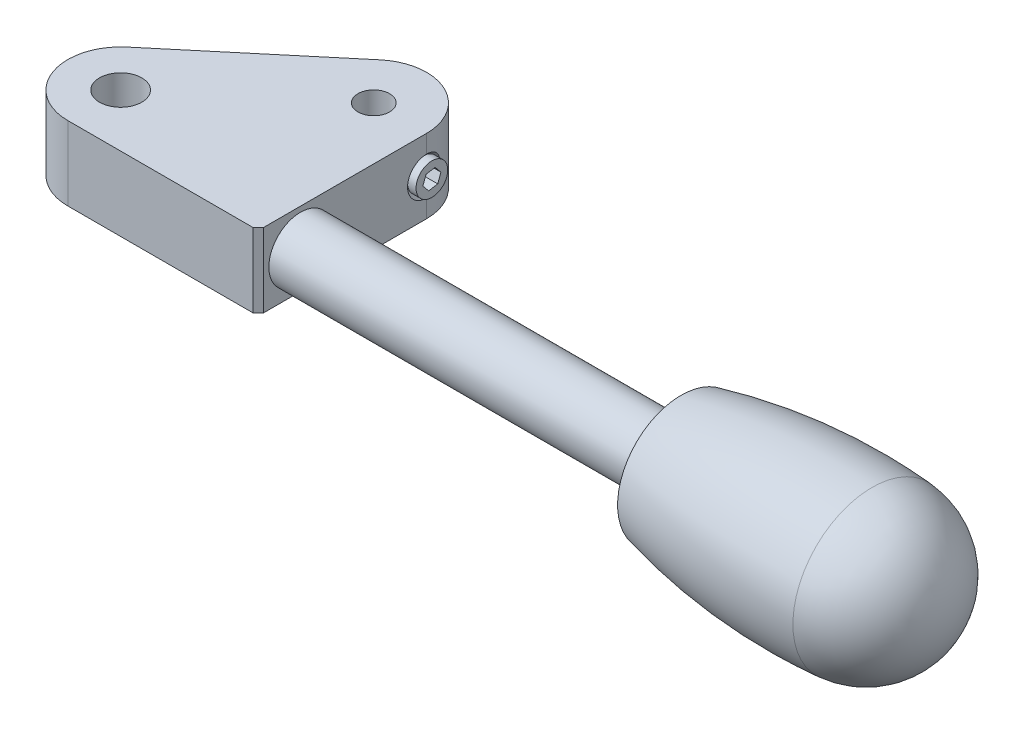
ISO-10303-21;
HEADER;
FILE_DESCRIPTION(('STEP AP214'),'2;1');
FILE_NAME('part.step','',(''),(''),'','','');
FILE_SCHEMA(('AUTOMOTIVE_DESIGN { 1 0 10303 214 1 1 1 1 }'));
ENDSEC;
DATA;
#1=APPLICATION_CONTEXT('core data for automotive mechanical design processes');
#2=APPLICATION_PROTOCOL_DEFINITION('international standard','automotive_design',2000,#1);
#3=PRODUCT_CONTEXT('',#1,'mechanical');
#4=PRODUCT('Part','Part','',(#3));
#5=PRODUCT_RELATED_PRODUCT_CATEGORY('part','',(#4));
#6=PRODUCT_DEFINITION_FORMATION('','',#4);
#7=PRODUCT_DEFINITION_CONTEXT('part definition',#1,'design');
#8=PRODUCT_DEFINITION('design','',#6,#7);
#9=PRODUCT_DEFINITION_SHAPE('','',#8);
#10=(LENGTH_UNIT() NAMED_UNIT(*) SI_UNIT(.MILLI.,.METRE.));
#11=(NAMED_UNIT(*) PLANE_ANGLE_UNIT() SI_UNIT($,.RADIAN.));
#12=(NAMED_UNIT(*) SI_UNIT($,.STERADIAN.) SOLID_ANGLE_UNIT());
#13=UNCERTAINTY_MEASURE_WITH_UNIT(LENGTH_MEASURE(1.E-05),#10,'distance_accuracy_value','');
#14=(GEOMETRIC_REPRESENTATION_CONTEXT(3) GLOBAL_UNCERTAINTY_ASSIGNED_CONTEXT((#13)) GLOBAL_UNIT_ASSIGNED_CONTEXT((#10,
#11,#12)) REPRESENTATION_CONTEXT('',''));
#15=CARTESIAN_POINT('',(0.,0.,0.));
#16=DIRECTION('',(0.,0.,1.));
#17=DIRECTION('',(1.,0.,0.));
#18=AXIS2_PLACEMENT_3D('',#15,#16,#17);
#19=CARTESIAN_POINT('',(70.0227555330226,0.,0.999999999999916));
#20=DIRECTION('',(-1.,0.,0.));
#21=DIRECTION('',(0.,-1.,0.));
#22=AXIS2_PLACEMENT_3D('',#19,#20,#21);
#23=CYLINDRICAL_SURFACE('',#22,3.);
#24=CARTESIAN_POINT('',(54.0227555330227,0.,0.999999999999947));
#25=DIRECTION('',(-1.,0.,0.));
#26=DIRECTION('',(0.,0.,-1.));
#27=AXIS2_PLACEMENT_3D('',#24,#25,#26);
#28=CIRCLE('',#27,3.);
#29=CARTESIAN_POINT('',(54.0227555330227,0.,-2.00000000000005));
#30=VERTEX_POINT('',#29);
#31=EDGE_CURVE('E18',#30,#30,#28,.T.);
#32=ORIENTED_EDGE('',*,*,#31,.T.);
#33=EDGE_LOOP('',(#32));
#34=FACE_BOUND('',#33,.T.);
#35=CARTESIAN_POINT('',(18.0227555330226,0.,1.));
#36=DIRECTION('',(-1.,0.,0.));
#37=DIRECTION('',(0.,0.,-1.));
#38=AXIS2_PLACEMENT_3D('',#35,#36,#37);
#39=CIRCLE('',#38,3.);
#40=CARTESIAN_POINT('',(18.0227555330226,0.,-2.));
#41=VERTEX_POINT('',#40);
#42=EDGE_CURVE('E9',#41,#41,#39,.F.);
#43=ORIENTED_EDGE('',*,*,#42,.T.);
#44=EDGE_LOOP('',(#43));
#45=FACE_BOUND('',#44,.T.);
#46=ADVANCED_FACE('F14',(#34,#45),#23,.T.);
#47=CARTESIAN_POINT('',(16.5227555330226,-0.145018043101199,-10.0735921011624));
#48=DIRECTION('',(1.,0.,0.));
#49=DIRECTION('',(0.,0.98588015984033,0.167452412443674));
#50=AXIS2_PLACEMENT_3D('',#47,#48,#49);
#51=PLANE('',#50);
#52=DIRECTION('',(0.,-0.937523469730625,0.347922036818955));
#53=VECTOR('',#52,1.);
#54=CARTESIAN_POINT('',(16.5227555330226,0.666901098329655,-10.374901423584));
#55=LINE('',#54,#53);
#56=CARTESIAN_POINT('',(16.5227555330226,0.666901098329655,-10.374901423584));
#57=VERTEX_POINT('',#56);
#58=CARTESIAN_POINT('',(16.5227555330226,-0.145018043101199,-10.0735921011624));
#59=VERTEX_POINT('',#58);
#60=EDGE_CURVE('E163',#57,#59,#55,.T.);
#61=ORIENTED_EDGE('',*,*,#60,.T.);
#62=DIRECTION('',(0.,-0.770071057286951,-0.637958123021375));
#63=VECTOR('',#62,1.);
#64=CARTESIAN_POINT('',(16.5227555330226,-0.145018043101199,-10.0735921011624));
#65=LINE('',#64,#63);
#66=CARTESIAN_POINT('',(16.5227555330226,-0.811919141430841,-10.6260800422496));
#67=VERTEX_POINT('',#66);
#68=EDGE_CURVE('E514',#59,#67,#65,.T.);
#69=ORIENTED_EDGE('',*,*,#68,.T.);
#70=DIRECTION('',(0.,0.167452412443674,-0.98588015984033));
#71=VECTOR('',#70,1.);
#72=CARTESIAN_POINT('',(16.5227555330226,-0.811919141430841,-10.6260800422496));
#73=LINE('',#72,#71);
#74=CARTESIAN_POINT('',(16.5227555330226,-0.666901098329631,-11.4798773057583));
#75=VERTEX_POINT('',#74);
#76=EDGE_CURVE('E515',#67,#75,#73,.T.);
#77=ORIENTED_EDGE('',*,*,#76,.T.);
#78=DIRECTION('',(0.,0.937523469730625,-0.347922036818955));
#79=VECTOR('',#78,1.);
#80=CARTESIAN_POINT('',(16.5227555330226,-0.666901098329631,-11.4798773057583));
#81=LINE('',#80,#79);
#82=CARTESIAN_POINT('',(16.5227555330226,0.145018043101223,-11.78118662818));
#83=VERTEX_POINT('',#82);
#84=EDGE_CURVE('E144',#75,#83,#81,.T.);
#85=ORIENTED_EDGE('',*,*,#84,.T.);
#86=DIRECTION('',(0.,0.770071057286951,0.637958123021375));
#87=VECTOR('',#86,1.);
#88=CARTESIAN_POINT('',(16.5227555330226,0.145018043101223,-11.78118662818));
#89=LINE('',#88,#87);
#90=CARTESIAN_POINT('',(16.5227555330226,0.811919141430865,-11.2286986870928));
#91=VERTEX_POINT('',#90);
#92=EDGE_CURVE('E130',#83,#91,#89,.T.);
#93=ORIENTED_EDGE('',*,*,#92,.T.);
#94=DIRECTION('',(0.,-0.167452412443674,0.98588015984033));
#95=VECTOR('',#94,1.);
#96=CARTESIAN_POINT('',(16.5227555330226,0.811919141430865,-11.2286986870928));
#97=LINE('',#96,#95);
#98=EDGE_CURVE('E141',#91,#57,#97,.T.);
#99=ORIENTED_EDGE('',*,*,#98,.T.);
#100=EDGE_LOOP('',(#61,#69,#77,#85,#93,#99));
#101=FACE_BOUND('',#100,.T.);
#102=ADVANCED_FACE('F140',(#101),#51,.T.);
#103=CARTESIAN_POINT('',(16.5227555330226,-0.145018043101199,-10.0735921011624));
#104=DIRECTION('',(0.,-0.637958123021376,0.770071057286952));
#105=DIRECTION('',(0.,-0.770071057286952,-0.637958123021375));
#106=AXIS2_PLACEMENT_3D('',#103,#104,#105);
#107=PLANE('',#106);
#108=DIRECTION('',(0.,-0.770071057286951,-0.637958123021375));
#109=VECTOR('',#108,1.);
#110=CARTESIAN_POINT('',(18.5227555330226,-0.145018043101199,-10.0735921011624));
#111=LINE('',#110,#109);
#112=CARTESIAN_POINT('',(18.5227555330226,-0.145018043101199,-10.0735921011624));
#113=VERTEX_POINT('',#112);
#114=CARTESIAN_POINT('',(18.5227555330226,-0.811919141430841,-10.6260800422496));
#115=VERTEX_POINT('',#114);
#116=EDGE_CURVE('E152',#113,#115,#111,.T.);
#117=ORIENTED_EDGE('',*,*,#116,.T.);
#118=DIRECTION('',(1.,0.,0.));
#119=VECTOR('',#118,1.);
#120=CARTESIAN_POINT('',(16.5227555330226,-0.811919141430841,-10.6260800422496));
#121=LINE('',#120,#119);
#122=EDGE_CURVE('E96',#67,#115,#121,.T.);
#123=ORIENTED_EDGE('',*,*,#122,.F.);
#124=ORIENTED_EDGE('',*,*,#68,.F.);
#125=DIRECTION('',(1.,0.,0.));
#126=VECTOR('',#125,1.);
#127=CARTESIAN_POINT('',(16.5227555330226,-0.145018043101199,-10.0735921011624));
#128=LINE('',#127,#126);
#129=EDGE_CURVE('E117',#59,#113,#128,.T.);
#130=ORIENTED_EDGE('',*,*,#129,.T.);
#131=EDGE_LOOP('',(#117,#123,#124,#130));
#132=FACE_BOUND('',#131,.T.);
#133=ADVANCED_FACE('F336',(#132),#107,.F.);
#134=CARTESIAN_POINT('',(16.5227555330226,-0.811919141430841,-10.6260800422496));
#135=DIRECTION('',(0.,-0.98588015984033,-0.167452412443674));
#136=DIRECTION('',(0.,0.167452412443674,-0.98588015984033));
#137=AXIS2_PLACEMENT_3D('',#134,#135,#136);
#138=PLANE('',#137);
#139=DIRECTION('',(0.,0.167452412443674,-0.98588015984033));
#140=VECTOR('',#139,1.);
#141=CARTESIAN_POINT('',(18.5227555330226,-0.811919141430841,-10.6260800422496));
#142=LINE('',#141,#140);
#143=CARTESIAN_POINT('',(18.5227555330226,-0.66690109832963,-11.4798773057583));
#144=VERTEX_POINT('',#143);
#145=EDGE_CURVE('E155',#115,#144,#142,.T.);
#146=ORIENTED_EDGE('',*,*,#145,.T.);
#147=DIRECTION('',(1.,0.,0.));
#148=VECTOR('',#147,1.);
#149=CARTESIAN_POINT('',(16.5227555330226,-0.666901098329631,-11.4798773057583));
#150=LINE('',#149,#148);
#151=EDGE_CURVE('E167',#75,#144,#150,.T.);
#152=ORIENTED_EDGE('',*,*,#151,.F.);
#153=ORIENTED_EDGE('',*,*,#76,.F.);
#154=ORIENTED_EDGE('',*,*,#122,.T.);
#155=EDGE_LOOP('',(#146,#152,#153,#154));
#156=FACE_BOUND('',#155,.T.);
#157=ADVANCED_FACE('F339',(#156),#138,.F.);
#158=CARTESIAN_POINT('',(16.5227555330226,-0.666901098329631,-11.4798773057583));
#159=DIRECTION('',(0.,-0.347922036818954,-0.937523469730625));
#160=DIRECTION('',(0.,0.937523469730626,-0.347922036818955));
#161=AXIS2_PLACEMENT_3D('',#158,#159,#160);
#162=PLANE('',#161);
#163=DIRECTION('',(0.,0.937523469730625,-0.347922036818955));
#164=VECTOR('',#163,1.);
#165=CARTESIAN_POINT('',(18.5227555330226,-0.66690109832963,-11.4798773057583));
#166=LINE('',#165,#164);
#167=CARTESIAN_POINT('',(18.5227555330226,0.145018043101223,-11.78118662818));
#168=VERTEX_POINT('',#167);
#169=EDGE_CURVE('E157',#144,#168,#166,.T.);
#170=ORIENTED_EDGE('',*,*,#169,.T.);
#171=DIRECTION('',(1.,0.,0.));
#172=VECTOR('',#171,1.);
#173=CARTESIAN_POINT('',(16.5227555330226,0.145018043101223,-11.78118662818));
#174=LINE('',#173,#172);
#175=EDGE_CURVE('E135',#83,#168,#174,.T.);
#176=ORIENTED_EDGE('',*,*,#175,.F.);
#177=ORIENTED_EDGE('',*,*,#84,.F.);
#178=ORIENTED_EDGE('',*,*,#151,.T.);
#179=EDGE_LOOP('',(#170,#176,#177,#178));
#180=FACE_BOUND('',#179,.T.);
#181=ADVANCED_FACE('F343',(#180),#162,.F.);
#182=CARTESIAN_POINT('',(16.5227555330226,0.145018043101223,-11.78118662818));
#183=DIRECTION('',(0.,0.637958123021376,-0.770071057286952));
#184=DIRECTION('',(0.,0.770071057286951,0.637958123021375));
#185=AXIS2_PLACEMENT_3D('',#182,#183,#184);
#186=PLANE('',#185);
#187=DIRECTION('',(0.,0.770071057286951,0.637958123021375));
#188=VECTOR('',#187,1.);
#189=CARTESIAN_POINT('',(18.5227555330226,0.145018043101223,-11.78118662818));
#190=LINE('',#189,#188);
#191=CARTESIAN_POINT('',(18.5227555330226,0.811919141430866,-11.2286986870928));
#192=VERTEX_POINT('',#191);
#193=EDGE_CURVE('E133',#168,#192,#190,.T.);
#194=ORIENTED_EDGE('',*,*,#193,.T.);
#195=DIRECTION('',(1.,0.,0.));
#196=VECTOR('',#195,1.);
#197=CARTESIAN_POINT('',(16.5227555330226,0.811919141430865,-11.2286986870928));
#198=LINE('',#197,#196);
#199=EDGE_CURVE('E110',#91,#192,#198,.T.);
#200=ORIENTED_EDGE('',*,*,#199,.F.);
#201=ORIENTED_EDGE('',*,*,#92,.F.);
#202=ORIENTED_EDGE('',*,*,#175,.T.);
#203=EDGE_LOOP('',(#194,#200,#201,#202));
#204=FACE_BOUND('',#203,.T.);
#205=ADVANCED_FACE('F129',(#204),#186,.F.);
#206=CARTESIAN_POINT('',(16.5227555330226,0.811919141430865,-11.2286986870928));
#207=DIRECTION('',(0.,0.98588015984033,0.167452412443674));
#208=DIRECTION('',(0.,-0.167452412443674,0.98588015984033));
#209=AXIS2_PLACEMENT_3D('',#206,#207,#208);
#210=PLANE('',#209);
#211=DIRECTION('',(0.,-0.167452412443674,0.98588015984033));
#212=VECTOR('',#211,1.);
#213=CARTESIAN_POINT('',(18.5227555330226,0.811919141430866,-11.2286986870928));
#214=LINE('',#213,#212);
#215=CARTESIAN_POINT('',(18.5227555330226,0.666901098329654,-10.374901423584));
#216=VERTEX_POINT('',#215);
#217=EDGE_CURVE('E161',#192,#216,#214,.T.);
#218=ORIENTED_EDGE('',*,*,#217,.T.);
#219=DIRECTION('',(1.,0.,0.));
#220=VECTOR('',#219,1.);
#221=CARTESIAN_POINT('',(16.5227555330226,0.666901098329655,-10.374901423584));
#222=LINE('',#221,#220);
#223=EDGE_CURVE('E114',#57,#216,#222,.T.);
#224=ORIENTED_EDGE('',*,*,#223,.F.);
#225=ORIENTED_EDGE('',*,*,#98,.F.);
#226=ORIENTED_EDGE('',*,*,#199,.T.);
#227=EDGE_LOOP('',(#218,#224,#225,#226));
#228=FACE_BOUND('',#227,.T.);
#229=ADVANCED_FACE('F146',(#228),#210,.F.);
#230=CARTESIAN_POINT('',(16.5227555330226,0.666901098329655,-10.374901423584));
#231=DIRECTION('',(0.,0.347922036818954,0.937523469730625));
#232=DIRECTION('',(0.,-0.937523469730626,0.347922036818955));
#233=AXIS2_PLACEMENT_3D('',#230,#231,#232);
#234=PLANE('',#233);
#235=DIRECTION('',(0.,-0.937523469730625,0.347922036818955));
#236=VECTOR('',#235,1.);
#237=CARTESIAN_POINT('',(18.5227555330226,0.666901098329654,-10.374901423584));
#238=LINE('',#237,#236);
#239=EDGE_CURVE('E33',#216,#113,#238,.T.);
#240=ORIENTED_EDGE('',*,*,#239,.T.);
#241=ORIENTED_EDGE('',*,*,#129,.F.);
#242=ORIENTED_EDGE('',*,*,#60,.F.);
#243=ORIENTED_EDGE('',*,*,#223,.T.);
#244=EDGE_LOOP('',(#240,#241,#242,#243));
#245=FACE_BOUND('',#244,.T.);
#246=ADVANCED_FACE('F330',(#245),#234,.F.);
#247=CARTESIAN_POINT('',(18.5227555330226,-0.251178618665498,-9.44856912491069));
#248=DIRECTION('',(1.,0.,0.));
#249=DIRECTION('',(0.,0.167452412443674,-0.98588015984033));
#250=AXIS2_PLACEMENT_3D('',#247,#248,#249);
#251=PLANE('',#250);
#252=ORIENTED_EDGE('',*,*,#239,.F.);
#253=ORIENTED_EDGE('',*,*,#217,.F.);
#254=ORIENTED_EDGE('',*,*,#193,.F.);
#255=ORIENTED_EDGE('',*,*,#169,.F.);
#256=ORIENTED_EDGE('',*,*,#145,.F.);
#257=ORIENTED_EDGE('',*,*,#116,.F.);
#258=EDGE_LOOP('',(#252,#253,#254,#255,#256,#257));
#259=FACE_BOUND('',#258,.T.);
#260=CARTESIAN_POINT('',(18.5227555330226,0.,-10.9273893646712));
#261=DIRECTION('',(-1.,0.,0.));
#262=DIRECTION('',(0.,-0.167452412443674,0.98588015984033));
#263=AXIS2_PLACEMENT_3D('',#260,#261,#262);
#264=CIRCLE('',#263,1.5);
#265=CARTESIAN_POINT('',(18.5227555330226,-0.251178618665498,-9.4485691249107));
#266=VERTEX_POINT('',#265);
#267=EDGE_CURVE('E164',#266,#266,#264,.T.);
#268=ORIENTED_EDGE('',*,*,#267,.F.);
#269=EDGE_LOOP('',(#268));
#270=FACE_BOUND('',#269,.T.);
#271=ADVANCED_FACE('F324',(#259,#270),#251,.T.);
#272=CARTESIAN_POINT('',(14.5227555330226,0.,-10.9273893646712));
#273=DIRECTION('',(-1.,0.,0.));
#274=DIRECTION('',(0.,-0.167452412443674,0.98588015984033));
#275=AXIS2_PLACEMENT_3D('',#272,#273,#274);
#276=CYLINDRICAL_SURFACE('',#275,1.5);
#277=ORIENTED_EDGE('',*,*,#267,.T.);
#278=EDGE_LOOP('',(#277));
#279=FACE_BOUND('',#278,.T.);
#280=CARTESIAN_POINT('',(17.7227555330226,0.,-10.9273893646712));
#281=DIRECTION('',(1.,0.,0.));
#282=DIRECTION('',(0.,0.,1.));
#283=AXIS2_PLACEMENT_3D('',#280,#281,#282);
#284=CIRCLE('',#283,1.5);
#285=CARTESIAN_POINT('',(17.7227555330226,0.,-9.4273893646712));
#286=VERTEX_POINT('',#285);
#287=EDGE_CURVE('E24',#286,#286,#284,.T.);
#288=ORIENTED_EDGE('',*,*,#287,.T.);
#289=EDGE_LOOP('',(#288));
#290=FACE_BOUND('',#289,.T.);
#291=ADVANCED_FACE('F261',(#279,#290),#276,.T.);
#292=CARTESIAN_POINT('',(0.,3.5,0.));
#293=DIRECTION('',(0.,-1.,0.));
#294=DIRECTION('',(0.766044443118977,0.,-0.642787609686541));
#295=AXIS2_PLACEMENT_3D('',#292,#293,#294);
#296=CYLINDRICAL_SURFACE('',#295,5.);
#297=CARTESIAN_POINT('',(0.,-3.5,0.));
#298=DIRECTION('',(0.,1.,0.));
#299=DIRECTION('',(-0.766044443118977,0.,0.642787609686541));
#300=AXIS2_PLACEMENT_3D('',#297,#298,#299);
#301=CIRCLE('',#300,5.);
#302=CARTESIAN_POINT('',(-3.21393804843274,-3.5,-3.83022221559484));
#303=VERTEX_POINT('',#302);
#304=CARTESIAN_POINT('',(0.,-3.5,5.));
#305=VERTEX_POINT('',#304);
#306=EDGE_CURVE('E187',#303,#305,#301,.T.);
#307=ORIENTED_EDGE('',*,*,#306,.T.);
#308=DIRECTION('',(0.,-1.,0.));
#309=VECTOR('',#308,1.);
#310=CARTESIAN_POINT('',(0.,3.5,5.));
#311=LINE('',#310,#309);
#312=CARTESIAN_POINT('',(0.,3.5,5.));
#313=VERTEX_POINT('',#312);
#314=EDGE_CURVE('E221',#313,#305,#311,.T.);
#315=ORIENTED_EDGE('',*,*,#314,.F.);
#316=CARTESIAN_POINT('',(0.,3.5,0.));
#317=DIRECTION('',(0.,1.,0.));
#318=DIRECTION('',(-0.766044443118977,0.,0.642787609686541));
#319=AXIS2_PLACEMENT_3D('',#316,#317,#318);
#320=CIRCLE('',#319,5.);
#321=CARTESIAN_POINT('',(-3.21393804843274,3.5,-3.83022221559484));
#322=VERTEX_POINT('',#321);
#323=EDGE_CURVE('E190',#322,#313,#320,.T.);
#324=ORIENTED_EDGE('',*,*,#323,.F.);
#325=DIRECTION('',(0.,-1.,0.));
#326=VECTOR('',#325,1.);
#327=CARTESIAN_POINT('',(-3.21393804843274,3.5,-3.83022221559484));
#328=LINE('',#327,#326);
#329=EDGE_CURVE('E202',#322,#303,#328,.T.);
#330=ORIENTED_EDGE('',*,*,#329,.T.);
#331=EDGE_LOOP('',(#307,#315,#324,#330));
#332=FACE_BOUND('',#331,.T.);
#333=ADVANCED_FACE('F258',(#332),#296,.T.);
#334=CARTESIAN_POINT('',(9.80881748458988,3.5,-14.757611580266));
#335=DIRECTION('',(0.642787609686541,0.,0.766044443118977));
#336=DIRECTION('',(0.,1.,0.));
#337=AXIS2_PLACEMENT_3D('',#334,#335,#336);
#338=PLANE('',#337);
#339=DIRECTION('',(-0.766044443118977,0.,0.642787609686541));
#340=VECTOR('',#339,1.);
#341=CARTESIAN_POINT('',(9.80881748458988,-3.5,-14.757611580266));
#342=LINE('',#341,#340);
#343=CARTESIAN_POINT('',(9.80881748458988,-3.5,-14.757611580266));
#344=VERTEX_POINT('',#343);
#345=EDGE_CURVE('E194',#344,#303,#342,.T.);
#346=ORIENTED_EDGE('',*,*,#345,.T.);
#347=ORIENTED_EDGE('',*,*,#329,.F.);
#348=DIRECTION('',(-0.766044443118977,0.,0.642787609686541));
#349=VECTOR('',#348,1.);
#350=CARTESIAN_POINT('',(9.80881748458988,3.5,-14.757611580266));
#351=LINE('',#350,#349);
#352=CARTESIAN_POINT('',(9.80881748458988,3.5,-14.757611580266));
#353=VERTEX_POINT('',#352);
#354=EDGE_CURVE('E200',#353,#322,#351,.T.);
#355=ORIENTED_EDGE('',*,*,#354,.F.);
#356=DIRECTION('',(0.,-1.,0.));
#357=VECTOR('',#356,1.);
#358=CARTESIAN_POINT('',(9.80881748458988,3.5,-14.757611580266));
#359=LINE('',#358,#357);
#360=EDGE_CURVE('E214',#353,#344,#359,.T.);
#361=ORIENTED_EDGE('',*,*,#360,.T.);
#362=EDGE_LOOP('',(#346,#347,#355,#361));
#363=FACE_BOUND('',#362,.T.);
#364=ADVANCED_FACE('F246',(#363),#338,.F.);
#365=CARTESIAN_POINT('',(18.0227555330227,3.5,5.));
#366=DIRECTION('',(0.,0.,-1.));
#367=DIRECTION('',(-1.,0.,0.));
#368=AXIS2_PLACEMENT_3D('',#365,#366,#367);
#369=PLANE('',#368);
#370=DIRECTION('',(1.,0.,0.));
#371=VECTOR('',#370,1.);
#372=CARTESIAN_POINT('',(18.0227555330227,-3.5,5.));
#373=LINE('',#372,#371);
#374=CARTESIAN_POINT('',(17.5227555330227,-3.5,5.));
#375=VERTEX_POINT('',#374);
#376=EDGE_CURVE('E205',#305,#375,#373,.T.);
#377=ORIENTED_EDGE('',*,*,#376,.T.);
#378=DIRECTION('',(0.,1.,0.));
#379=VECTOR('',#378,1.);
#380=CARTESIAN_POINT('',(17.5227555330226,3.5,5.));
#381=LINE('',#380,#379);
#382=CARTESIAN_POINT('',(17.5227555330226,3.5,5.));
#383=VERTEX_POINT('',#382);
#384=EDGE_CURVE('E87',#375,#383,#381,.T.);
#385=ORIENTED_EDGE('',*,*,#384,.T.);
#386=DIRECTION('',(1.,0.,0.));
#387=VECTOR('',#386,1.);
#388=CARTESIAN_POINT('',(18.0227555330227,3.5,5.));
#389=LINE('',#388,#387);
#390=EDGE_CURVE('E193',#313,#383,#389,.T.);
#391=ORIENTED_EDGE('',*,*,#390,.F.);
#392=ORIENTED_EDGE('',*,*,#314,.T.);
#393=EDGE_LOOP('',(#377,#385,#391,#392));
#394=FACE_BOUND('',#393,.T.);
#395=ADVANCED_FACE('F254',(#394),#369,.F.);
#396=CARTESIAN_POINT('',(13.0227555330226,-3.5,-10.9273893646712));
#397=DIRECTION('',(0.,1.,0.));
#398=DIRECTION('',(-0.766044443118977,0.,0.642787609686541));
#399=AXIS2_PLACEMENT_3D('',#396,#397,#398);
#400=CYLINDRICAL_SURFACE('',#399,1.5);
#401=CARTESIAN_POINT('',(13.0227555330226,-3.5,-10.9273893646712));
#402=DIRECTION('',(0.,1.,0.));
#403=DIRECTION('',(-0.766044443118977,0.,0.642787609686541));
#404=AXIS2_PLACEMENT_3D('',#401,#402,#403);
#405=CIRCLE('',#404,1.5);
#406=CARTESIAN_POINT('',(11.8736888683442,-3.5,-9.96320795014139));
#407=VERTEX_POINT('',#406);
#408=EDGE_CURVE('E184',#407,#407,#405,.T.);
#409=ORIENTED_EDGE('',*,*,#408,.F.);
#410=EDGE_LOOP('',(#409));
#411=FACE_BOUND('',#410,.T.);
#412=CARTESIAN_POINT('',(13.0227555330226,3.5,-10.9273893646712));
#413=DIRECTION('',(0.,1.,0.));
#414=DIRECTION('',(-0.766044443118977,0.,0.642787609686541));
#415=AXIS2_PLACEMENT_3D('',#412,#413,#414);
#416=CIRCLE('',#415,1.5);
#417=CARTESIAN_POINT('',(11.8736888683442,3.5,-9.96320795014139));
#418=VERTEX_POINT('',#417);
#419=EDGE_CURVE('E181',#418,#418,#416,.T.);
#420=ORIENTED_EDGE('',*,*,#419,.T.);
#421=EDGE_LOOP('',(#420));
#422=FACE_BOUND('',#421,.T.);
#423=ADVANCED_FACE('F257',(#411,#422),#400,.F.);
#424=CARTESIAN_POINT('',(0.,-3.5,0.));
#425=DIRECTION('',(0.,1.,0.));
#426=DIRECTION('',(-0.766044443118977,0.,0.642787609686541));
#427=AXIS2_PLACEMENT_3D('',#424,#425,#426);
#428=CYLINDRICAL_SURFACE('',#427,2.);
#429=CARTESIAN_POINT('',(0.,-3.5,0.));
#430=DIRECTION('',(0.,1.,0.));
#431=DIRECTION('',(-0.766044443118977,0.,0.642787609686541));
#432=AXIS2_PLACEMENT_3D('',#429,#430,#431);
#433=CIRCLE('',#432,2.);
#434=CARTESIAN_POINT('',(-1.53208888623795,-3.5,1.28557521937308));
#435=VERTEX_POINT('',#434);
#436=EDGE_CURVE('E178',#435,#435,#433,.T.);
#437=ORIENTED_EDGE('',*,*,#436,.F.);
#438=EDGE_LOOP('',(#437));
#439=FACE_BOUND('',#438,.T.);
#440=CARTESIAN_POINT('',(0.,3.5,0.));
#441=DIRECTION('',(0.,1.,0.));
#442=DIRECTION('',(-0.766044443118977,0.,0.642787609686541));
#443=AXIS2_PLACEMENT_3D('',#440,#441,#442);
#444=CIRCLE('',#443,2.);
#445=CARTESIAN_POINT('',(-1.53208888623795,3.5,1.28557521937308));
#446=VERTEX_POINT('',#445);
#447=EDGE_CURVE('E176',#446,#446,#444,.T.);
#448=ORIENTED_EDGE('',*,*,#447,.T.);
#449=EDGE_LOOP('',(#448));
#450=FACE_BOUND('',#449,.T.);
#451=ADVANCED_FACE('F314',(#439,#450),#428,.F.);
#452=CARTESIAN_POINT('',(18.0227555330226,0.,-10.9273893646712));
#453=DIRECTION('',(1.,0.,0.));
#454=DIRECTION('',(0.,0.,-1.));
#455=AXIS2_PLACEMENT_3D('',#452,#453,#454);
#456=CONICAL_SURFACE('',#455,1.8,0.785398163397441);
#457=ORIENTED_EDGE('',*,*,#287,.F.);
#458=EDGE_LOOP('',(#457));
#459=FACE_BOUND('',#458,.T.);
#460=CARTESIAN_POINT('',(18.0227555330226,0.,-10.9273893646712));
#461=DIRECTION('',(1.,0.,0.));
#462=DIRECTION('',(0.,0.,-1.));
#463=AXIS2_PLACEMENT_3D('',#460,#461,#462);
#464=CIRCLE('',#463,1.8);
#465=CARTESIAN_POINT('',(18.0227555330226,1.8,-10.9273893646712));
#466=VERTEX_POINT('',#465);
#467=CARTESIAN_POINT('',(18.0227555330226,-1.8,-10.9273893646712));
#468=VERTEX_POINT('',#467);
#469=EDGE_CURVE('E174',#466,#468,#464,.T.);
#470=ORIENTED_EDGE('',*,*,#469,.T.);
#471=CARTESIAN_POINT('',(18.0037379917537,-1.72687138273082,-10.4917131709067));
#472=CARTESIAN_POINT('',(18.0067635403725,-1.73871490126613,-10.5262887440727));
#473=CARTESIAN_POINT('',(18.0094654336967,-1.7491932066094,-10.5613475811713));
#474=CARTESIAN_POINT('',(18.0141634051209,-1.76730520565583,-10.6322460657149));
#475=CARTESIAN_POINT('',(18.0161593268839,-1.77493826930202,-10.6680858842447));
#476=CARTESIAN_POINT('',(18.0209884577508,-1.79335285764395,-10.7762492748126));
#477=CARTESIAN_POINT('',(18.0226826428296,-1.79972511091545,-10.8494350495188));
#478=CARTESIAN_POINT('',(18.0228240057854,-1.80025820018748,-10.9959418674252));
#479=CARTESIAN_POINT('',(18.0212657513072,-1.79439860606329,-11.0692629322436));
#480=CARTESIAN_POINT('',(18.0150684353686,-1.77078824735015,-11.2138303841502));
#481=CARTESIAN_POINT('',(18.010428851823,-1.75303546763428,-11.2850764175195));
#482=CARTESIAN_POINT('',(17.9985616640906,-1.70663338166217,-11.4235625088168));
#483=CARTESIAN_POINT('',(17.9913369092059,-1.67799606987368,-11.4908068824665));
#484=CARTESIAN_POINT('',(17.9749794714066,-1.61114487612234,-11.6200060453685));
#485=CARTESIAN_POINT('',(17.9658483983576,-1.57293906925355,-11.6819652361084));
#486=CARTESIAN_POINT('',(17.9495641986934,-1.50201428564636,-11.780733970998));
#487=CARTESIAN_POINT('',(17.9427222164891,-1.47149623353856,-11.8192126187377));
#488=CARTESIAN_POINT('',(17.923768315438,-1.38423571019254,-11.9194641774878));
#489=CARTESIAN_POINT('',(17.9113606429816,-1.32424596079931,-11.9784010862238));
#490=CARTESIAN_POINT('',(17.8867372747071,-1.19622798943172,-12.0870449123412));
#491=CARTESIAN_POINT('',(17.8745221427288,-1.1281798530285,-12.1367281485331));
#492=CARTESIAN_POINT('',(17.8494630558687,-0.974525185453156,-12.2334418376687));
#493=CARTESIAN_POINT('',(17.836823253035,-0.887841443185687,-12.2788209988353));
#494=CARTESIAN_POINT('',(17.8144604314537,-0.708355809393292,-12.3560894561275));
#495=CARTESIAN_POINT('',(17.8047372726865,-0.615554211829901,-12.3879793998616));
#496=CARTESIAN_POINT('',(17.78845258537,-0.416979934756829,-12.4403221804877));
#497=CARTESIAN_POINT('',(17.7822778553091,-0.310811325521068,-12.4594052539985));
#498=CARTESIAN_POINT('',(17.7753642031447,-0.0966139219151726,-12.4807201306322));
#499=CARTESIAN_POINT('',(17.7746263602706,0.0114152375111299,-12.4829485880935));
#500=CARTESIAN_POINT('',(17.7787235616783,0.228724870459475,-12.4703782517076));
#501=CARTESIAN_POINT('',(17.7836793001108,0.337981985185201,-12.4552107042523));
#502=CARTESIAN_POINT('',(17.7987320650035,0.552304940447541,-12.4074797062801));
#503=CARTESIAN_POINT('',(17.8088309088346,0.657369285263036,-12.3749101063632));
#504=CARTESIAN_POINT('',(17.8328748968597,0.860067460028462,-12.2928824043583));
#505=CARTESIAN_POINT('',(17.8468150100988,0.957710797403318,-12.2434463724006));
#506=CARTESIAN_POINT('',(17.8767714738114,1.1425087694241,-12.1282463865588));
#507=CARTESIAN_POINT('',(17.8927864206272,1.22967041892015,-12.0624934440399));
#508=CARTESIAN_POINT('',(17.9215741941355,1.37413228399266,-11.9299944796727));
#509=CARTESIAN_POINT('',(17.934366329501,1.43393563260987,-11.8659771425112));
#510=CARTESIAN_POINT('',(17.958607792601,1.54222467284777,-11.7287646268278));
#511=CARTESIAN_POINT('',(17.970058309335,1.59072042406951,-11.6555776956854));
#512=CARTESIAN_POINT('',(17.9903877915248,1.67435312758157,-11.5007629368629));
#513=CARTESIAN_POINT('',(17.9992459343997,1.70938258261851,-11.4190735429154));
#514=CARTESIAN_POINT('',(18.0130411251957,1.7631546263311,-11.2501843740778));
#515=CARTESIAN_POINT('',(18.0179818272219,1.78191239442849,-11.1629898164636));
#516=CARTESIAN_POINT('',(18.0228262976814,1.80028346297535,-10.9986848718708));
#517=CARTESIAN_POINT('',(18.0233327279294,1.80218777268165,-10.921849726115));
#518=CARTESIAN_POINT('',(18.0214586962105,1.79509488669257,-10.8071847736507));
#519=CARTESIAN_POINT('',(18.020389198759,1.7910501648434,-10.7689682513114));
#520=CARTESIAN_POINT('',(18.0174058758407,1.77969823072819,-10.6930506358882));
#521=CARTESIAN_POINT('',(18.0154919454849,1.77239061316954,-10.6553496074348));
#522=CARTESIAN_POINT('',(18.0131765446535,1.76349348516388,-10.6180382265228));
#523=B_SPLINE_CURVE_WITH_KNOTS('',3,(#471,#472,#473,#474,#475,#476,#477,#478,#479,#480,#481,
#482,#483,#484,#485,#486,#487,#488,#489,#490,#491,#492,#493,#494,#495,#496,#497,#498,#499,#500,
#501,#502,#503,#504,#505,#506,#507,#508,#509,#510,#511,#512,#513,#514,#515,#516,#517,#518,#519,
#520,#521,#522),.UNSPECIFIED.,.F.,.F.,(4,2,2,2,2,2,2,2,2,2,2,2,2,2,2,2,2,2,2,2,2,2,2,2,2,4),(0.,
0.109961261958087,0.219946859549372,0.439231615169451,0.658882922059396,0.878571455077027,
1.09801859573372,1.31728115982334,1.4658683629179,1.7198473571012,1.97446764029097,
2.26920485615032,2.56392792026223,2.88657268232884,3.20928148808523,3.53895939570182,
3.86875387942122,4.19811846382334,4.52726138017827,4.79179305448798,5.05608848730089,
5.32245194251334,5.58856664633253,5.81783749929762,5.93303837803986,6.0482535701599),.UNSPECIFIED.);
#524=EDGE_CURVE('E224',#466,#468,#523,.F.);
#525=ORIENTED_EDGE('',*,*,#524,.F.);
#526=EDGE_LOOP('',(#470,#525));
#527=FACE_BOUND('',#526,.T.);
#528=ADVANCED_FACE('F235',(#459,#527),#456,.F.);
#529=CARTESIAN_POINT('',(13.0227555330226,3.5,-10.9273893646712));
#530=DIRECTION('',(0.,-1.,0.));
#531=DIRECTION('',(0.766044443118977,0.,-0.642787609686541));
#532=AXIS2_PLACEMENT_3D('',#529,#530,#531);
#533=CYLINDRICAL_SURFACE('',#532,5.);
#534=DIRECTION('',(0.,-1.,0.));
#535=VECTOR('',#534,1.);
#536=CARTESIAN_POINT('',(18.0227555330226,3.5,-10.9273893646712));
#537=LINE('',#536,#535);
#538=CARTESIAN_POINT('',(18.0227555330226,3.5,-10.9273893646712));
#539=VERTEX_POINT('',#538);
#540=EDGE_CURVE('E218',#539,#466,#537,.T.);
#541=ORIENTED_EDGE('',*,*,#540,.T.);
#542=ORIENTED_EDGE('',*,*,#524,.T.);
#543=CARTESIAN_POINT('',(18.0227555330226,-3.5,-10.9273893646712));
#544=VERTEX_POINT('',#543);
#545=EDGE_CURVE('E217',#468,#544,#537,.T.);
#546=ORIENTED_EDGE('',*,*,#545,.T.);
#547=CARTESIAN_POINT('',(13.0227555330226,-3.5,-10.9273893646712));
#548=DIRECTION('',(0.,1.,0.));
#549=DIRECTION('',(-0.766044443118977,0.,0.642787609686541));
#550=AXIS2_PLACEMENT_3D('',#547,#548,#549);
#551=CIRCLE('',#550,5.);
#552=EDGE_CURVE('E209',#544,#344,#551,.T.);
#553=ORIENTED_EDGE('',*,*,#552,.T.);
#554=ORIENTED_EDGE('',*,*,#360,.F.);
#555=CARTESIAN_POINT('',(13.0227555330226,3.5,-10.9273893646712));
#556=DIRECTION('',(0.,1.,0.));
#557=DIRECTION('',(-0.766044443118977,0.,0.642787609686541));
#558=AXIS2_PLACEMENT_3D('',#555,#556,#557);
#559=CIRCLE('',#558,5.);
#560=EDGE_CURVE('E198',#539,#353,#559,.T.);
#561=ORIENTED_EDGE('',*,*,#560,.F.);
#562=EDGE_LOOP('',(#541,#542,#546,#553,#554,#561));
#563=FACE_BOUND('',#562,.T.);
#564=ADVANCED_FACE('F239',(#563),#533,.T.);
#565=CARTESIAN_POINT('',(0.,-3.5,0.));
#566=DIRECTION('',(0.,1.,0.));
#567=DIRECTION('',(-0.766044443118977,0.,0.642787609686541));
#568=AXIS2_PLACEMENT_3D('',#565,#566,#567);
#569=PLANE('',#568);
#570=ORIENTED_EDGE('',*,*,#436,.T.);
#571=EDGE_LOOP('',(#570));
#572=FACE_BOUND('',#571,.T.);
#573=DIRECTION('',(0.,0.,-1.));
#574=VECTOR('',#573,1.);
#575=CARTESIAN_POINT('',(18.0227555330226,-3.5,-10.9273893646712));
#576=LINE('',#575,#574);
#577=CARTESIAN_POINT('',(18.0227555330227,-3.5,4.5));
#578=VERTEX_POINT('',#577);
#579=EDGE_CURVE('E207',#578,#544,#576,.T.);
#580=ORIENTED_EDGE('',*,*,#579,.F.);
#581=DIRECTION('',(0.707106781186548,0.,-0.707106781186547));
#582=VECTOR('',#581,1.);
#583=CARTESIAN_POINT('',(18.0227555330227,-3.5,4.5));
#584=LINE('',#583,#582);
#585=EDGE_CURVE('E81',#578,#375,#584,.F.);
#586=ORIENTED_EDGE('',*,*,#585,.T.);
#587=ORIENTED_EDGE('',*,*,#376,.F.);
#588=ORIENTED_EDGE('',*,*,#306,.F.);
#589=ORIENTED_EDGE('',*,*,#345,.F.);
#590=ORIENTED_EDGE('',*,*,#552,.F.);
#591=EDGE_LOOP('',(#580,#586,#587,#588,#589,#590));
#592=FACE_BOUND('',#591,.T.);
#593=ORIENTED_EDGE('',*,*,#408,.T.);
#594=EDGE_LOOP('',(#593));
#595=FACE_BOUND('',#594,.T.);
#596=ADVANCED_FACE('F244',(#572,#592,#595),#569,.F.);
#597=CARTESIAN_POINT('',(18.0227555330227,3.5,4.5));
#598=DIRECTION('',(-0.707106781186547,0.,-0.707106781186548));
#599=DIRECTION('',(-0.707106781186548,0.,0.707106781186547));
#600=AXIS2_PLACEMENT_3D('',#597,#598,#599);
#601=PLANE('',#600);
#602=DIRECTION('',(-0.707106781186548,0.,0.707106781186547));
#603=VECTOR('',#602,1.);
#604=CARTESIAN_POINT('',(11.2613777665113,3.5,11.2613777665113));
#605=LINE('',#604,#603);
#606=CARTESIAN_POINT('',(18.0227555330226,3.5,4.5));
#607=VERTEX_POINT('',#606);
#608=EDGE_CURVE('E153',#383,#607,#605,.F.);
#609=ORIENTED_EDGE('',*,*,#608,.F.);
#610=ORIENTED_EDGE('',*,*,#384,.F.);
#611=ORIENTED_EDGE('',*,*,#585,.F.);
#612=DIRECTION('',(0.,-1.,0.));
#613=VECTOR('',#612,1.);
#614=CARTESIAN_POINT('',(18.0227555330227,3.5,4.5));
#615=LINE('',#614,#613);
#616=EDGE_CURVE('E233',#607,#578,#615,.T.);
#617=ORIENTED_EDGE('',*,*,#616,.F.);
#618=EDGE_LOOP('',(#609,#610,#611,#617));
#619=FACE_BOUND('',#618,.T.);
#620=ADVANCED_FACE('F263',(#619),#601,.F.);
#621=CARTESIAN_POINT('',(0.,3.5,0.));
#622=DIRECTION('',(0.,1.,0.));
#623=DIRECTION('',(-0.766044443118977,0.,0.642787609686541));
#624=AXIS2_PLACEMENT_3D('',#621,#622,#623);
#625=PLANE('',#624);
#626=ORIENTED_EDGE('',*,*,#447,.F.);
#627=EDGE_LOOP('',(#626));
#628=FACE_BOUND('',#627,.T.);
#629=ORIENTED_EDGE('',*,*,#390,.T.);
#630=ORIENTED_EDGE('',*,*,#608,.T.);
#631=DIRECTION('',(0.,0.,-1.));
#632=VECTOR('',#631,1.);
#633=CARTESIAN_POINT('',(18.0227555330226,3.5,-10.9273893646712));
#634=LINE('',#633,#632);
#635=EDGE_CURVE('E196',#607,#539,#634,.T.);
#636=ORIENTED_EDGE('',*,*,#635,.T.);
#637=ORIENTED_EDGE('',*,*,#560,.T.);
#638=ORIENTED_EDGE('',*,*,#354,.T.);
#639=ORIENTED_EDGE('',*,*,#323,.T.);
#640=EDGE_LOOP('',(#629,#630,#636,#637,#638,#639));
#641=FACE_BOUND('',#640,.T.);
#642=ORIENTED_EDGE('',*,*,#419,.F.);
#643=EDGE_LOOP('',(#642));
#644=FACE_BOUND('',#643,.T.);
#645=ADVANCED_FACE('F252',(#628,#641,#644),#625,.T.);
#646=CARTESIAN_POINT('',(18.0227555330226,3.5,-10.9273893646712));
#647=DIRECTION('',(-1.,0.,0.));
#648=DIRECTION('',(0.,0.,1.));
#649=AXIS2_PLACEMENT_3D('',#646,#647,#648);
#650=PLANE('',#649);
#651=ORIENTED_EDGE('',*,*,#635,.F.);
#652=ORIENTED_EDGE('',*,*,#616,.T.);
#653=ORIENTED_EDGE('',*,*,#579,.T.);
#654=ORIENTED_EDGE('',*,*,#545,.F.);
#655=ORIENTED_EDGE('',*,*,#469,.F.);
#656=ORIENTED_EDGE('',*,*,#540,.F.);
#657=EDGE_LOOP('',(#651,#652,#653,#654,#655,#656));
#658=FACE_BOUND('',#657,.T.);
#659=ORIENTED_EDGE('',*,*,#42,.F.);
#660=EDGE_LOOP('',(#659));
#661=FACE_BOUND('',#660,.T.);
#662=ADVANCED_FACE('F248',(#658,#661),#650,.F.);
#663=CARTESIAN_POINT('',(71.5227555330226,0.,0.99999999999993));
#664=DIRECTION('',(-1.,0.,0.));
#665=DIRECTION('',(0.,-1.,0.));
#666=AXIS2_PLACEMENT_3D('',#663,#664,#665);
#667=SPHERICAL_SURFACE('',#666,7.5);
#668=CARTESIAN_POINT('',(72.0862099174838,0.,0.999999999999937));
#669=DIRECTION('',(-1.,0.,0.));
#670=DIRECTION('',(0.,0.,-1.));
#671=AXIS2_PLACEMENT_3D('',#668,#669,#670);
#672=CIRCLE('',#671,7.47880466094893);
#673=CARTESIAN_POINT('',(72.0862099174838,0.,-6.47880466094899));
#674=VERTEX_POINT('',#673);
#675=EDGE_CURVE('E284',#674,#674,#672,.T.);
#676=ORIENTED_EDGE('',*,*,#675,.F.);
#677=EDGE_LOOP('',(#676));
#678=FACE_BOUND('',#677,.T.);
#679=ADVANCED_FACE('F251',(#678),#667,.T.);
#680=CARTESIAN_POINT('',(67.7288293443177,0.,0.999999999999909));
#681=DIRECTION('',(-1.,0.,0.));
#682=DIRECTION('',(0.,0.,-1.));
#683=AXIS2_PLACEMENT_3D('',#680,#681,#682);
#684=DEGENERATE_TOROIDAL_SURFACE('',#683,50.3572847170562,58.,.F.);
#685=ORIENTED_EDGE('',*,*,#675,.T.);
#686=EDGE_LOOP('',(#685));
#687=FACE_BOUND('',#686,.T.);
#688=CARTESIAN_POINT('',(54.0227555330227,0.,0.999999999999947));
#689=DIRECTION('',(-1.,0.,0.));
#690=DIRECTION('',(0.,0.,-1.));
#691=AXIS2_PLACEMENT_3D('',#688,#689,#690);
#692=CIRCLE('',#691,6.);
#693=CARTESIAN_POINT('',(54.0227555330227,0.,-5.00000000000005));
#694=VERTEX_POINT('',#693);
#695=EDGE_CURVE('E177',#694,#694,#692,.T.);
#696=ORIENTED_EDGE('',*,*,#695,.F.);
#697=EDGE_LOOP('',(#696));
#698=FACE_BOUND('',#697,.T.);
#699=ADVANCED_FACE('F271',(#687,#698),#684,.F.);
#700=CARTESIAN_POINT('',(54.0227555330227,0.,0.999999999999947));
#701=DIRECTION('',(-1.,0.,0.));
#702=DIRECTION('',(0.,0.,-1.));
#703=AXIS2_PLACEMENT_3D('',#700,#701,#702);
#704=PLANE('',#703);
#705=ORIENTED_EDGE('',*,*,#695,.T.);
#706=EDGE_LOOP('',(#705));
#707=FACE_BOUND('',#706,.T.);
#708=ORIENTED_EDGE('',*,*,#31,.F.);
#709=EDGE_LOOP('',(#708));
#710=FACE_BOUND('',#709,.T.);
#711=ADVANCED_FACE('F16',(#707,#710),#704,.T.);
#712=CLOSED_SHELL('',(#46,#102,#133,#157,#181,#205,#229,#246,#271,#291,#333,#364,#395,#423,#451,
#528,#564,#596,#620,#645,#662,#679,#699,#711));
#713=MANIFOLD_SOLID_BREP('B1',#712);
#714=ADVANCED_BREP_SHAPE_REPRESENTATION('',(#18,#713),#14);
#715=SHAPE_DEFINITION_REPRESENTATION(#9,#714);
ENDSEC;
END-ISO-10303-21;
